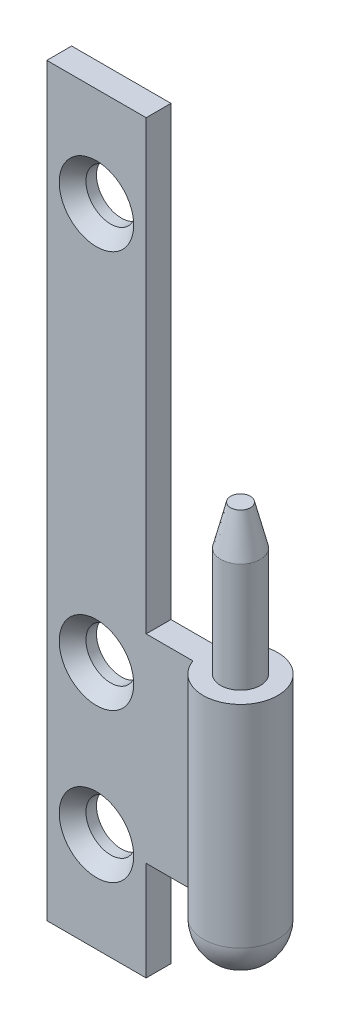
ISO-10303-21;
HEADER;
FILE_DESCRIPTION(('STEP AP214'),'2;1');
FILE_NAME('part.step','',(''),(''),'','','');
FILE_SCHEMA(('AUTOMOTIVE_DESIGN { 1 0 10303 214 1 1 1 1 }'));
ENDSEC;
DATA;
#1=APPLICATION_CONTEXT('core data for automotive mechanical design processes');
#2=APPLICATION_PROTOCOL_DEFINITION('international standard','automotive_design',2000,#1);
#3=PRODUCT_CONTEXT('',#1,'mechanical');
#4=PRODUCT('Part','Part','',(#3));
#5=PRODUCT_RELATED_PRODUCT_CATEGORY('part','',(#4));
#6=PRODUCT_DEFINITION_FORMATION('','',#4);
#7=PRODUCT_DEFINITION_CONTEXT('part definition',#1,'design');
#8=PRODUCT_DEFINITION('design','',#6,#7);
#9=PRODUCT_DEFINITION_SHAPE('','',#8);
#10=(LENGTH_UNIT() NAMED_UNIT(*) SI_UNIT(.MILLI.,.METRE.));
#11=(NAMED_UNIT(*) PLANE_ANGLE_UNIT() SI_UNIT($,.RADIAN.));
#12=(NAMED_UNIT(*) SI_UNIT($,.STERADIAN.) SOLID_ANGLE_UNIT());
#13=UNCERTAINTY_MEASURE_WITH_UNIT(LENGTH_MEASURE(1.E-05),#10,'distance_accuracy_value','');
#14=(GEOMETRIC_REPRESENTATION_CONTEXT(3) GLOBAL_UNCERTAINTY_ASSIGNED_CONTEXT((#13)) GLOBAL_UNIT_ASSIGNED_CONTEXT((#10,
#11,#12)) REPRESENTATION_CONTEXT('',''));
#15=CARTESIAN_POINT('',(0.,0.,0.));
#16=DIRECTION('',(0.,0.,1.));
#17=DIRECTION('',(1.,0.,0.));
#18=AXIS2_PLACEMENT_3D('',#15,#16,#17);
#19=CARTESIAN_POINT('',(20.,0.,2.5));
#20=DIRECTION('',(-1.,0.,0.));
#21=DIRECTION('',(0.,0.,1.));
#22=AXIS2_PLACEMENT_3D('',#19,#20,#21);
#23=PLANE('',#22);
#24=DIRECTION('',(0.,0.,1.));
#25=VECTOR('',#24,1.);
#26=CARTESIAN_POINT('',(20.,60.,2.50000000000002));
#27=LINE('',#26,#25);
#28=CARTESIAN_POINT('',(20.,60.,-2.5));
#29=VERTEX_POINT('',#28);
#30=CARTESIAN_POINT('',(20.,60.,2.5));
#31=VERTEX_POINT('',#30);
#32=EDGE_CURVE('E118',#29,#31,#27,.T.);
#33=ORIENTED_EDGE('',*,*,#32,.F.);
#34=DIRECTION('',(0.,1.,0.));
#35=VECTOR('',#34,1.);
#36=CARTESIAN_POINT('',(20.,0.,-2.5));
#37=LINE('',#36,#35);
#38=CARTESIAN_POINT('',(20.,150.,-2.5));
#39=VERTEX_POINT('',#38);
#40=EDGE_CURVE('E115',#29,#39,#37,.T.);
#41=ORIENTED_EDGE('',*,*,#40,.T.);
#42=DIRECTION('',(0.,0.,-1.));
#43=VECTOR('',#42,1.);
#44=CARTESIAN_POINT('',(20.,150.,2.5));
#45=LINE('',#44,#43);
#46=CARTESIAN_POINT('',(20.,150.,2.5));
#47=VERTEX_POINT('',#46);
#48=EDGE_CURVE('E200',#47,#39,#45,.T.);
#49=ORIENTED_EDGE('',*,*,#48,.F.);
#50=DIRECTION('',(0.,1.,0.));
#51=VECTOR('',#50,1.);
#52=CARTESIAN_POINT('',(20.,0.,2.5));
#53=LINE('',#52,#51);
#54=EDGE_CURVE('E128',#31,#47,#53,.T.);
#55=ORIENTED_EDGE('',*,*,#54,.F.);
#56=EDGE_LOOP('',(#33,#41,#49,#55));
#57=FACE_BOUND('',#56,.T.);
#58=ADVANCED_FACE('F32',(#57),#23,.F.);
#59=DIRECTION('',(0.,0.,-1.));
#60=VECTOR('',#59,1.);
#61=CARTESIAN_POINT('',(20.,20.,2.50000000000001));
#62=LINE('',#61,#60);
#63=CARTESIAN_POINT('',(20.,20.,2.5));
#64=VERTEX_POINT('',#63);
#65=CARTESIAN_POINT('',(20.,20.,-2.5));
#66=VERTEX_POINT('',#65);
#67=EDGE_CURVE('E110',#64,#66,#62,.T.);
#68=ORIENTED_EDGE('',*,*,#67,.F.);
#69=CARTESIAN_POINT('',(20.,0.,2.5));
#70=VERTEX_POINT('',#69);
#71=EDGE_CURVE('E202',#70,#64,#53,.T.);
#72=ORIENTED_EDGE('',*,*,#71,.F.);
#73=DIRECTION('',(0.,0.,-1.));
#74=VECTOR('',#73,1.);
#75=CARTESIAN_POINT('',(20.,0.,2.5));
#76=LINE('',#75,#74);
#77=CARTESIAN_POINT('',(20.,0.,-2.5));
#78=VERTEX_POINT('',#77);
#79=EDGE_CURVE('E113',#70,#78,#76,.T.);
#80=ORIENTED_EDGE('',*,*,#79,.T.);
#81=EDGE_CURVE('E100',#78,#66,#37,.T.);
#82=ORIENTED_EDGE('',*,*,#81,.T.);
#83=EDGE_LOOP('',(#68,#72,#80,#82));
#84=FACE_BOUND('',#83,.T.);
#85=ADVANCED_FACE('F108',(#84),#23,.F.);
#86=CARTESIAN_POINT('',(0.,0.,2.5));
#87=DIRECTION('',(1.,0.,0.));
#88=DIRECTION('',(0.,0.,-1.));
#89=AXIS2_PLACEMENT_3D('',#86,#87,#88);
#90=PLANE('',#89);
#91=DIRECTION('',(0.,-1.,0.));
#92=VECTOR('',#91,1.);
#93=CARTESIAN_POINT('',(0.,0.,-2.5));
#94=LINE('',#93,#92);
#95=CARTESIAN_POINT('',(0.,150.,-2.5));
#96=VERTEX_POINT('',#95);
#97=CARTESIAN_POINT('',(0.,0.,-2.5));
#98=VERTEX_POINT('',#97);
#99=EDGE_CURVE('E149',#96,#98,#94,.T.);
#100=ORIENTED_EDGE('',*,*,#99,.T.);
#101=DIRECTION('',(0.,0.,-1.));
#102=VECTOR('',#101,1.);
#103=CARTESIAN_POINT('',(0.,0.,2.5));
#104=LINE('',#103,#102);
#105=CARTESIAN_POINT('',(0.,0.,2.5));
#106=VERTEX_POINT('',#105);
#107=EDGE_CURVE('E151',#106,#98,#104,.T.);
#108=ORIENTED_EDGE('',*,*,#107,.F.);
#109=DIRECTION('',(0.,-1.,0.));
#110=VECTOR('',#109,1.);
#111=CARTESIAN_POINT('',(0.,0.,2.5));
#112=LINE('',#111,#110);
#113=CARTESIAN_POINT('',(0.,150.,2.5));
#114=VERTEX_POINT('',#113);
#115=EDGE_CURVE('E138',#114,#106,#112,.T.);
#116=ORIENTED_EDGE('',*,*,#115,.F.);
#117=DIRECTION('',(0.,0.,-1.));
#118=VECTOR('',#117,1.);
#119=CARTESIAN_POINT('',(0.,150.,2.5));
#120=LINE('',#119,#118);
#121=EDGE_CURVE('E219',#114,#96,#120,.T.);
#122=ORIENTED_EDGE('',*,*,#121,.T.);
#123=EDGE_LOOP('',(#100,#108,#116,#122));
#124=FACE_BOUND('',#123,.T.);
#125=ADVANCED_FACE('F231',(#124),#90,.F.);
#126=CARTESIAN_POINT('',(0.,0.,2.5));
#127=DIRECTION('',(0.,1.,0.));
#128=DIRECTION('',(0.,0.,1.));
#129=AXIS2_PLACEMENT_3D('',#126,#127,#128);
#130=PLANE('',#129);
#131=DIRECTION('',(1.,0.,0.));
#132=VECTOR('',#131,1.);
#133=CARTESIAN_POINT('',(0.,0.,-2.5));
#134=LINE('',#133,#132);
#135=EDGE_CURVE('E212',#98,#78,#134,.T.);
#136=ORIENTED_EDGE('',*,*,#135,.T.);
#137=ORIENTED_EDGE('',*,*,#79,.F.);
#138=DIRECTION('',(1.,0.,0.));
#139=VECTOR('',#138,1.);
#140=CARTESIAN_POINT('',(0.,0.,2.5));
#141=LINE('',#140,#139);
#142=EDGE_CURVE('E203',#106,#70,#141,.T.);
#143=ORIENTED_EDGE('',*,*,#142,.F.);
#144=ORIENTED_EDGE('',*,*,#107,.T.);
#145=EDGE_LOOP('',(#136,#137,#143,#144));
#146=FACE_BOUND('',#145,.T.);
#147=ADVANCED_FACE('F227',(#146),#130,.F.);
#148=CARTESIAN_POINT('',(0.,150.,2.5));
#149=DIRECTION('',(0.,-1.,0.));
#150=DIRECTION('',(0.,0.,-1.));
#151=AXIS2_PLACEMENT_3D('',#148,#149,#150);
#152=PLANE('',#151);
#153=DIRECTION('',(-1.,0.,0.));
#154=VECTOR('',#153,1.);
#155=CARTESIAN_POINT('',(0.,150.,-2.5));
#156=LINE('',#155,#154);
#157=EDGE_CURVE('E114',#39,#96,#156,.T.);
#158=ORIENTED_EDGE('',*,*,#157,.T.);
#159=ORIENTED_EDGE('',*,*,#121,.F.);
#160=DIRECTION('',(-1.,0.,0.));
#161=VECTOR('',#160,1.);
#162=CARTESIAN_POINT('',(0.,150.,2.5));
#163=LINE('',#162,#161);
#164=EDGE_CURVE('E204',#47,#114,#163,.T.);
#165=ORIENTED_EDGE('',*,*,#164,.F.);
#166=ORIENTED_EDGE('',*,*,#48,.T.);
#167=EDGE_LOOP('',(#158,#159,#165,#166));
#168=FACE_BOUND('',#167,.T.);
#169=ADVANCED_FACE('F235',(#168),#152,.F.);
#170=CARTESIAN_POINT('',(0.,150.,2.5));
#171=DIRECTION('',(0.,0.,-1.));
#172=DIRECTION('',(-1.,0.,0.));
#173=AXIS2_PLACEMENT_3D('',#170,#171,#172);
#174=PLANE('',#173);
#175=CARTESIAN_POINT('',(10.,20.,2.5));
#176=DIRECTION('',(0.,0.,1.));
#177=DIRECTION('',(1.,0.,0.));
#178=AXIS2_PLACEMENT_3D('',#175,#176,#177);
#179=CIRCLE('',#178,7.5);
#180=CARTESIAN_POINT('',(17.5,20.,2.5));
#181=VERTEX_POINT('',#180);
#182=EDGE_CURVE('E421',#181,#181,#179,.T.);
#183=ORIENTED_EDGE('',*,*,#182,.F.);
#184=EDGE_LOOP('',(#183));
#185=FACE_BOUND('',#184,.T.);
#186=CARTESIAN_POINT('',(10.,50.,2.5));
#187=DIRECTION('',(0.,0.,1.));
#188=DIRECTION('',(1.,0.,0.));
#189=AXIS2_PLACEMENT_3D('',#186,#187,#188);
#190=CIRCLE('',#189,7.5);
#191=CARTESIAN_POINT('',(17.5,50.,2.5));
#192=VERTEX_POINT('',#191);
#193=EDGE_CURVE('E166',#192,#192,#190,.T.);
#194=ORIENTED_EDGE('',*,*,#193,.F.);
#195=EDGE_LOOP('',(#194));
#196=FACE_BOUND('',#195,.T.);
#197=CARTESIAN_POINT('',(10.,130.,2.5));
#198=DIRECTION('',(0.,0.,1.));
#199=DIRECTION('',(1.,0.,0.));
#200=AXIS2_PLACEMENT_3D('',#197,#198,#199);
#201=CIRCLE('',#200,7.5);
#202=CARTESIAN_POINT('',(17.5,130.,2.5));
#203=VERTEX_POINT('',#202);
#204=EDGE_CURVE('E159',#203,#203,#201,.T.);
#205=ORIENTED_EDGE('',*,*,#204,.F.);
#206=EDGE_LOOP('',(#205));
#207=FACE_BOUND('',#206,.T.);
#208=DIRECTION('',(-1.,0.,0.));
#209=VECTOR('',#208,1.);
#210=CARTESIAN_POINT('',(30.,20.,2.50000000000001));
#211=LINE('',#210,#209);
#212=CARTESIAN_POINT('',(29.4289321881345,20.,2.50000000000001));
#213=VERTEX_POINT('',#212);
#214=EDGE_CURVE('E102',#213,#64,#211,.T.);
#215=ORIENTED_EDGE('',*,*,#214,.F.);
#216=DIRECTION('',(0.,1.,0.));
#217=VECTOR('',#216,1.);
#218=CARTESIAN_POINT('',(29.4289321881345,90.,2.5));
#219=LINE('',#218,#217);
#220=CARTESIAN_POINT('',(29.4289321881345,60.,2.50000000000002));
#221=VERTEX_POINT('',#220);
#222=EDGE_CURVE('E119',#213,#221,#219,.T.);
#223=ORIENTED_EDGE('',*,*,#222,.T.);
#224=DIRECTION('',(-1.,0.,0.));
#225=VECTOR('',#224,1.);
#226=CARTESIAN_POINT('',(30.,60.,2.50000000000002));
#227=LINE('',#226,#225);
#228=EDGE_CURVE('E122',#221,#31,#227,.T.);
#229=ORIENTED_EDGE('',*,*,#228,.T.);
#230=ORIENTED_EDGE('',*,*,#54,.T.);
#231=ORIENTED_EDGE('',*,*,#164,.T.);
#232=ORIENTED_EDGE('',*,*,#115,.T.);
#233=ORIENTED_EDGE('',*,*,#142,.T.);
#234=ORIENTED_EDGE('',*,*,#71,.T.);
#235=EDGE_LOOP('',(#215,#223,#229,#230,#231,#232,#233,#234));
#236=FACE_BOUND('',#235,.T.);
#237=ADVANCED_FACE('F195',(#185,#196,#207,#236),#174,.F.);
#238=CARTESIAN_POINT('',(0.,150.,-2.5));
#239=DIRECTION('',(0.,0.,-1.));
#240=DIRECTION('',(-1.,0.,0.));
#241=AXIS2_PLACEMENT_3D('',#238,#239,#240);
#242=PLANE('',#241);
#243=CARTESIAN_POINT('',(10.,20.,-2.5));
#244=DIRECTION('',(0.,0.,-1.));
#245=DIRECTION('',(-1.,0.,0.));
#246=AXIS2_PLACEMENT_3D('',#243,#244,#245);
#247=CIRCLE('',#246,5.);
#248=CARTESIAN_POINT('',(5.00000000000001,20.,-2.5));
#249=VERTEX_POINT('',#248);
#250=EDGE_CURVE('E36',#249,#249,#247,.T.);
#251=ORIENTED_EDGE('',*,*,#250,.F.);
#252=EDGE_LOOP('',(#251));
#253=FACE_BOUND('',#252,.T.);
#254=CARTESIAN_POINT('',(10.,50.,-2.5));
#255=DIRECTION('',(0.,0.,-1.));
#256=DIRECTION('',(-1.,0.,0.));
#257=AXIS2_PLACEMENT_3D('',#254,#255,#256);
#258=CIRCLE('',#257,5.);
#259=CARTESIAN_POINT('',(5.00000000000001,50.,-2.5));
#260=VERTEX_POINT('',#259);
#261=EDGE_CURVE('E157',#260,#260,#258,.T.);
#262=ORIENTED_EDGE('',*,*,#261,.F.);
#263=EDGE_LOOP('',(#262));
#264=FACE_BOUND('',#263,.T.);
#265=CARTESIAN_POINT('',(10.,130.,-2.5));
#266=DIRECTION('',(0.,0.,-1.));
#267=DIRECTION('',(-1.,0.,0.));
#268=AXIS2_PLACEMENT_3D('',#265,#266,#267);
#269=CIRCLE('',#268,5.);
#270=CARTESIAN_POINT('',(5.,130.,-2.5));
#271=VERTEX_POINT('',#270);
#272=EDGE_CURVE('E153',#271,#271,#269,.T.);
#273=ORIENTED_EDGE('',*,*,#272,.F.);
#274=EDGE_LOOP('',(#273));
#275=FACE_BOUND('',#274,.T.);
#276=DIRECTION('',(0.,1.,0.));
#277=VECTOR('',#276,1.);
#278=CARTESIAN_POINT('',(29.4289321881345,90.,-2.5));
#279=LINE('',#278,#277);
#280=CARTESIAN_POINT('',(29.4289321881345,20.,-2.5));
#281=VERTEX_POINT('',#280);
#282=CARTESIAN_POINT('',(29.4289321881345,60.,-2.5));
#283=VERTEX_POINT('',#282);
#284=EDGE_CURVE('E57',#281,#283,#279,.T.);
#285=ORIENTED_EDGE('',*,*,#284,.F.);
#286=DIRECTION('',(-1.,0.,0.));
#287=VECTOR('',#286,1.);
#288=CARTESIAN_POINT('',(30.,20.,-2.5));
#289=LINE('',#288,#287);
#290=EDGE_CURVE('E97',#281,#66,#289,.T.);
#291=ORIENTED_EDGE('',*,*,#290,.T.);
#292=ORIENTED_EDGE('',*,*,#81,.F.);
#293=ORIENTED_EDGE('',*,*,#135,.F.);
#294=ORIENTED_EDGE('',*,*,#99,.F.);
#295=ORIENTED_EDGE('',*,*,#157,.F.);
#296=ORIENTED_EDGE('',*,*,#40,.F.);
#297=DIRECTION('',(-1.,0.,0.));
#298=VECTOR('',#297,1.);
#299=CARTESIAN_POINT('',(30.,60.,-2.5));
#300=LINE('',#299,#298);
#301=EDGE_CURVE('E103',#283,#29,#300,.T.);
#302=ORIENTED_EDGE('',*,*,#301,.F.);
#303=EDGE_LOOP('',(#285,#291,#292,#293,#294,#295,#296,#302));
#304=FACE_BOUND('',#303,.T.);
#305=ADVANCED_FACE('F99',(#253,#264,#275,#304),#242,.T.);
#306=CARTESIAN_POINT('',(30.,20.,2.50000000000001));
#307=DIRECTION('',(0.,1.,0.));
#308=DIRECTION('',(0.,0.,1.));
#309=AXIS2_PLACEMENT_3D('',#306,#307,#308);
#310=PLANE('',#309);
#311=ORIENTED_EDGE('',*,*,#290,.F.);
#312=CARTESIAN_POINT('',(36.5,20.,0.));
#313=DIRECTION('',(0.,1.,0.));
#314=DIRECTION('',(0.,0.,1.));
#315=AXIS2_PLACEMENT_3D('',#312,#313,#314);
#316=CIRCLE('',#315,7.5);
#317=EDGE_CURVE('E49',#281,#213,#316,.T.);
#318=ORIENTED_EDGE('',*,*,#317,.T.);
#319=ORIENTED_EDGE('',*,*,#214,.T.);
#320=ORIENTED_EDGE('',*,*,#67,.T.);
#321=EDGE_LOOP('',(#311,#318,#319,#320));
#322=FACE_BOUND('',#321,.T.);
#323=ADVANCED_FACE('F117',(#322),#310,.F.);
#324=CARTESIAN_POINT('',(30.,60.,2.50000000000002));
#325=DIRECTION('',(0.,-1.,0.));
#326=DIRECTION('',(0.,0.,-1.));
#327=AXIS2_PLACEMENT_3D('',#324,#325,#326);
#328=PLANE('',#327);
#329=ORIENTED_EDGE('',*,*,#228,.F.);
#330=CARTESIAN_POINT('',(36.5,60.,0.));
#331=DIRECTION('',(0.,1.,0.));
#332=DIRECTION('',(-1.,0.,0.));
#333=AXIS2_PLACEMENT_3D('',#330,#331,#332);
#334=CIRCLE('',#333,7.5);
#335=EDGE_CURVE('E178',#221,#283,#334,.T.);
#336=ORIENTED_EDGE('',*,*,#335,.T.);
#337=ORIENTED_EDGE('',*,*,#301,.T.);
#338=ORIENTED_EDGE('',*,*,#32,.T.);
#339=EDGE_LOOP('',(#329,#336,#337,#338));
#340=FACE_BOUND('',#339,.T.);
#341=CARTESIAN_POINT('',(36.5,60.,0.));
#342=DIRECTION('',(0.,1.,0.));
#343=DIRECTION('',(-1.,0.,0.));
#344=AXIS2_PLACEMENT_3D('',#341,#342,#343);
#345=CIRCLE('',#344,3.99999999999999);
#346=CARTESIAN_POINT('',(32.5,60.,0.));
#347=VERTEX_POINT('',#346);
#348=EDGE_CURVE('E181',#347,#347,#345,.T.);
#349=ORIENTED_EDGE('',*,*,#348,.F.);
#350=EDGE_LOOP('',(#349));
#351=FACE_BOUND('',#350,.T.);
#352=ADVANCED_FACE('F190',(#340,#351),#328,.F.);
#353=CARTESIAN_POINT('',(36.5,90.,0.));
#354=DIRECTION('',(0.,1.,0.));
#355=DIRECTION('',(-1.,0.,0.));
#356=AXIS2_PLACEMENT_3D('',#353,#354,#355);
#357=CYLINDRICAL_SURFACE('',#356,7.5);
#358=CARTESIAN_POINT('',(36.5,17.5,0.));
#359=DIRECTION('',(0.,1.,0.));
#360=DIRECTION('',(-1.,0.,0.));
#361=AXIS2_PLACEMENT_3D('',#358,#359,#360);
#362=CIRCLE('',#361,7.5);
#363=CARTESIAN_POINT('',(29.,17.5,0.));
#364=VERTEX_POINT('',#363);
#365=EDGE_CURVE('E155',#364,#364,#362,.T.);
#366=ORIENTED_EDGE('',*,*,#365,.T.);
#367=EDGE_LOOP('',(#366));
#368=FACE_BOUND('',#367,.T.);
#369=ORIENTED_EDGE('',*,*,#222,.F.);
#370=ORIENTED_EDGE('',*,*,#317,.F.);
#371=ORIENTED_EDGE('',*,*,#284,.T.);
#372=ORIENTED_EDGE('',*,*,#335,.F.);
#373=EDGE_LOOP('',(#369,#370,#371,#372));
#374=FACE_BOUND('',#373,.T.);
#375=ADVANCED_FACE('F187',(#368,#374),#357,.T.);
#376=CARTESIAN_POINT('',(36.5,90.,0.));
#377=DIRECTION('',(0.,1.,0.));
#378=DIRECTION('',(-1.,0.,0.));
#379=AXIS2_PLACEMENT_3D('',#376,#377,#378);
#380=PLANE('',#379);
#381=CARTESIAN_POINT('',(36.5,90.,0.));
#382=DIRECTION('',(0.,1.,0.));
#383=DIRECTION('',(-1.,0.,0.));
#384=AXIS2_PLACEMENT_3D('',#381,#382,#383);
#385=CIRCLE('',#384,1.99999999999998);
#386=CARTESIAN_POINT('',(34.5,90.,0.));
#387=VERTEX_POINT('',#386);
#388=EDGE_CURVE('E41',#387,#387,#385,.T.);
#389=ORIENTED_EDGE('',*,*,#388,.T.);
#390=EDGE_LOOP('',(#389));
#391=FACE_BOUND('',#390,.T.);
#392=ADVANCED_FACE('F303',(#391),#380,.T.);
#393=CARTESIAN_POINT('',(36.5,90.,0.));
#394=DIRECTION('',(0.,1.,0.));
#395=DIRECTION('',(-1.,0.,0.));
#396=AXIS2_PLACEMENT_3D('',#393,#394,#395);
#397=CYLINDRICAL_SURFACE('',#396,3.99999999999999);
#398=CARTESIAN_POINT('',(36.5,81.9999999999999,0.));
#399=DIRECTION('',(0.,1.,0.));
#400=DIRECTION('',(0.,0.,1.));
#401=AXIS2_PLACEMENT_3D('',#398,#399,#400);
#402=CIRCLE('',#401,3.99999999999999);
#403=CARTESIAN_POINT('',(36.5,81.9999999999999,3.99999999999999));
#404=VERTEX_POINT('',#403);
#405=EDGE_CURVE('E11',#404,#404,#402,.F.);
#406=ORIENTED_EDGE('',*,*,#405,.T.);
#407=EDGE_LOOP('',(#406));
#408=FACE_BOUND('',#407,.T.);
#409=ORIENTED_EDGE('',*,*,#348,.T.);
#410=EDGE_LOOP('',(#409));
#411=FACE_BOUND('',#410,.T.);
#412=ADVANCED_FACE('F316',(#408,#411),#397,.T.);
#413=CARTESIAN_POINT('',(36.5,17.5,0.));
#414=DIRECTION('',(0.,1.,0.));
#415=DIRECTION('',(-1.,0.,0.));
#416=AXIS2_PLACEMENT_3D('',#413,#414,#415);
#417=SPHERICAL_SURFACE('',#416,7.5);
#418=ORIENTED_EDGE('',*,*,#365,.F.);
#419=EDGE_LOOP('',(#418));
#420=FACE_BOUND('',#419,.T.);
#421=ADVANCED_FACE('F311',(#420),#417,.T.);
#422=CARTESIAN_POINT('',(36.5,90.,0.));
#423=DIRECTION('',(0.,-1.,0.));
#424=DIRECTION('',(0.,0.,-1.));
#425=AXIS2_PLACEMENT_3D('',#422,#423,#424);
#426=CONICAL_SURFACE('',#425,1.99999999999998,0.244978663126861);
#427=ORIENTED_EDGE('',*,*,#405,.F.);
#428=EDGE_LOOP('',(#427));
#429=FACE_BOUND('',#428,.T.);
#430=ORIENTED_EDGE('',*,*,#388,.F.);
#431=EDGE_LOOP('',(#430));
#432=FACE_BOUND('',#431,.T.);
#433=ADVANCED_FACE('F34',(#429,#432),#426,.T.);
#434=CARTESIAN_POINT('',(10.,130.,2.5));
#435=DIRECTION('',(0.,0.,1.));
#436=DIRECTION('',(1.,0.,0.));
#437=AXIS2_PLACEMENT_3D('',#434,#435,#436);
#438=CYLINDRICAL_SURFACE('',#437,5.);
#439=ORIENTED_EDGE('',*,*,#272,.T.);
#440=EDGE_LOOP('',(#439));
#441=FACE_BOUND('',#440,.T.);
#442=CARTESIAN_POINT('',(10.,130.,-0.375921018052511));
#443=DIRECTION('',(0.,0.,1.));
#444=DIRECTION('',(1.,0.,0.));
#445=AXIS2_PLACEMENT_3D('',#442,#443,#444);
#446=CIRCLE('',#445,5.);
#447=CARTESIAN_POINT('',(15.,130.,-0.375921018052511));
#448=VERTEX_POINT('',#447);
#449=EDGE_CURVE('E156',#448,#448,#446,.T.);
#450=ORIENTED_EDGE('',*,*,#449,.T.);
#451=EDGE_LOOP('',(#450));
#452=FACE_BOUND('',#451,.T.);
#453=ADVANCED_FACE('F342',(#441,#452),#438,.F.);
#454=CARTESIAN_POINT('',(10.,130.,2.5));
#455=DIRECTION('',(0.,0.,1.));
#456=DIRECTION('',(1.,0.,0.));
#457=AXIS2_PLACEMENT_3D('',#454,#455,#456);
#458=CONICAL_SURFACE('',#457,7.5,0.715584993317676);
#459=ORIENTED_EDGE('',*,*,#449,.F.);
#460=EDGE_LOOP('',(#459));
#461=FACE_BOUND('',#460,.T.);
#462=ORIENTED_EDGE('',*,*,#204,.T.);
#463=EDGE_LOOP('',(#462));
#464=FACE_BOUND('',#463,.T.);
#465=ADVANCED_FACE('F362',(#461,#464),#458,.F.);
#466=CARTESIAN_POINT('',(10.,50.,2.5));
#467=DIRECTION('',(0.,0.,1.));
#468=DIRECTION('',(1.,0.,0.));
#469=AXIS2_PLACEMENT_3D('',#466,#467,#468);
#470=CYLINDRICAL_SURFACE('',#469,5.);
#471=ORIENTED_EDGE('',*,*,#261,.T.);
#472=EDGE_LOOP('',(#471));
#473=FACE_BOUND('',#472,.T.);
#474=CARTESIAN_POINT('',(10.,50.,-0.375921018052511));
#475=DIRECTION('',(0.,0.,1.));
#476=DIRECTION('',(1.,0.,0.));
#477=AXIS2_PLACEMENT_3D('',#474,#475,#476);
#478=CIRCLE('',#477,5.);
#479=CARTESIAN_POINT('',(15.,50.,-0.375921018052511));
#480=VERTEX_POINT('',#479);
#481=EDGE_CURVE('E160',#480,#480,#478,.T.);
#482=ORIENTED_EDGE('',*,*,#481,.T.);
#483=EDGE_LOOP('',(#482));
#484=FACE_BOUND('',#483,.T.);
#485=ADVANCED_FACE('F372',(#473,#484),#470,.F.);
#486=CARTESIAN_POINT('',(10.,50.,2.5));
#487=DIRECTION('',(0.,0.,1.));
#488=DIRECTION('',(1.,0.,0.));
#489=AXIS2_PLACEMENT_3D('',#486,#487,#488);
#490=CONICAL_SURFACE('',#489,7.5,0.715584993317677);
#491=ORIENTED_EDGE('',*,*,#481,.F.);
#492=EDGE_LOOP('',(#491));
#493=FACE_BOUND('',#492,.T.);
#494=ORIENTED_EDGE('',*,*,#193,.T.);
#495=EDGE_LOOP('',(#494));
#496=FACE_BOUND('',#495,.T.);
#497=ADVANCED_FACE('F382',(#493,#496),#490,.F.);
#498=CARTESIAN_POINT('',(10.,20.,2.5));
#499=DIRECTION('',(0.,0.,1.));
#500=DIRECTION('',(1.,0.,0.));
#501=AXIS2_PLACEMENT_3D('',#498,#499,#500);
#502=CYLINDRICAL_SURFACE('',#501,5.);
#503=ORIENTED_EDGE('',*,*,#250,.T.);
#504=EDGE_LOOP('',(#503));
#505=FACE_BOUND('',#504,.T.);
#506=CARTESIAN_POINT('',(10.,20.,-0.375921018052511));
#507=DIRECTION('',(0.,0.,1.));
#508=DIRECTION('',(1.,0.,0.));
#509=AXIS2_PLACEMENT_3D('',#506,#507,#508);
#510=CIRCLE('',#509,5.);
#511=CARTESIAN_POINT('',(15.,20.,-0.375921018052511));
#512=VERTEX_POINT('',#511);
#513=EDGE_CURVE('E418',#512,#512,#510,.T.);
#514=ORIENTED_EDGE('',*,*,#513,.T.);
#515=EDGE_LOOP('',(#514));
#516=FACE_BOUND('',#515,.T.);
#517=ADVANCED_FACE('F391',(#505,#516),#502,.F.);
#518=CARTESIAN_POINT('',(10.,20.,2.5));
#519=DIRECTION('',(0.,0.,1.));
#520=DIRECTION('',(1.,0.,0.));
#521=AXIS2_PLACEMENT_3D('',#518,#519,#520);
#522=CONICAL_SURFACE('',#521,7.5,0.715584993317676);
#523=ORIENTED_EDGE('',*,*,#513,.F.);
#524=EDGE_LOOP('',(#523));
#525=FACE_BOUND('',#524,.T.);
#526=ORIENTED_EDGE('',*,*,#182,.T.);
#527=EDGE_LOOP('',(#526));
#528=FACE_BOUND('',#527,.T.);
#529=ADVANCED_FACE('F401',(#525,#528),#522,.F.);
#530=CLOSED_SHELL('',(#58,#85,#125,#147,#169,#237,#305,#323,#352,#375,#392,#412,#421,#433,#453,
#465,#485,#497,#517,#529));
#531=MANIFOLD_SOLID_BREP('B2',#530);
#532=ADVANCED_BREP_SHAPE_REPRESENTATION('',(#18,#531),#14);
#533=SHAPE_DEFINITION_REPRESENTATION(#9,#532);
ENDSEC;
END-ISO-10303-21;
